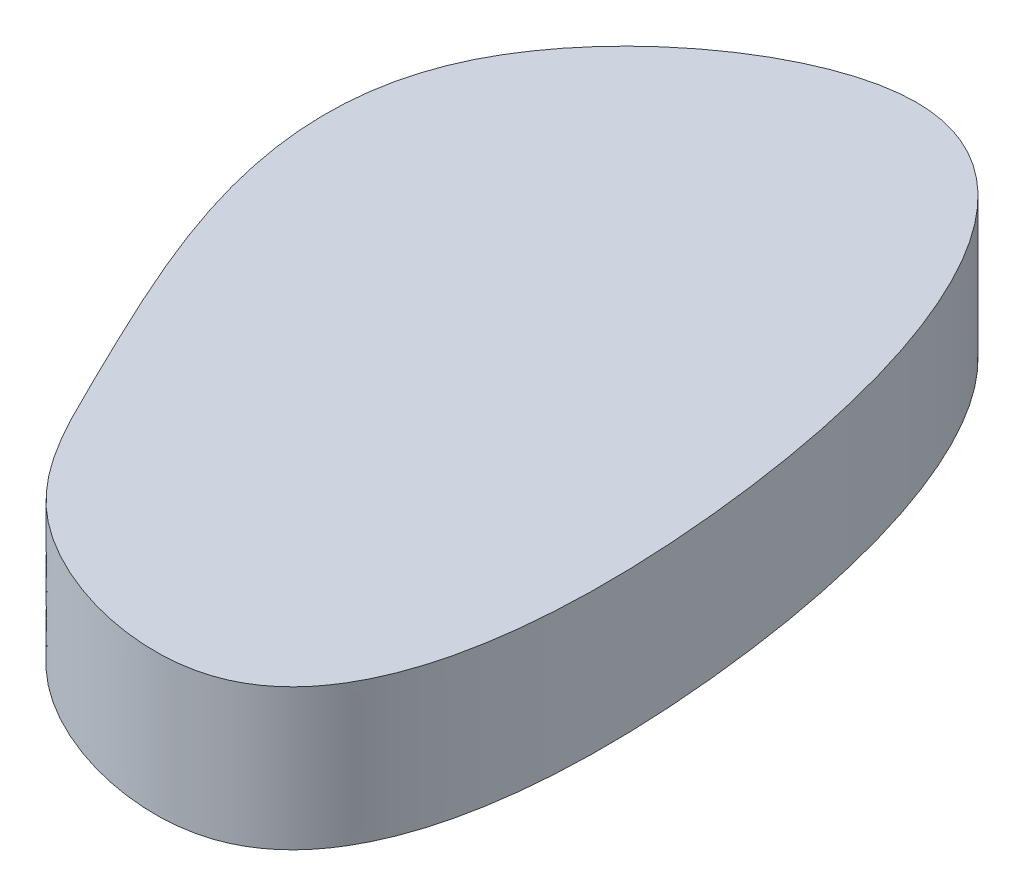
from build123d import *

# Parameters (mm, degrees)
EXTRUDE1_DEPTH = 14.351


with BuildPart() as part:
    # Sketch1 → Extrude1 (new, symmetric)
    with BuildSketch(Plane(origin=(0, 0, 0), x_dir=(1, 0, 0), z_dir=(0, 1, 0))):
        with BuildLine():
            add(Edge.make_bspline(
                [(0, 0), (-14.690886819, 30.211828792), (-43.903867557, 87.998960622), (55.100968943, 161.134096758), (94.870244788, 49.7134446), (84.961040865, -53.844180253), (16.751384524, -34.86674005), (5.372244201, -11.04802753), (0, 0)],
                knots=[0, 0, 0, 0, 0.223211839, 0.372718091, 0.620747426, 0.814133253, 0.918374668, 1, 1, 1, 1], degree=3))
        make_face()
    extrude(amount=EXTRUDE1_DEPTH, both=True)


solid = part.part
